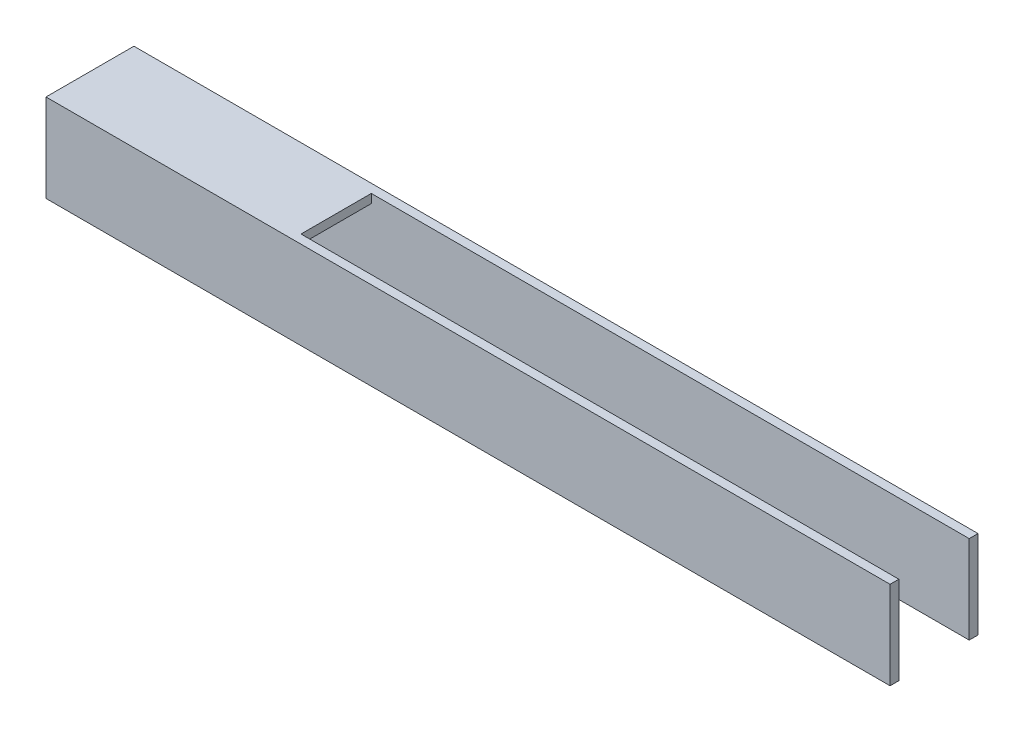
from build123d import *

# Parameters (mm, degrees)
BOSS_EXTRUDE1_DEPTH = 304.8
SKETCH2_W           = 215.9
SKETCH2_H           = 25.4
CUT_EXTRUDE1_DEPTH  = 307.547853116


with BuildPart() as part:
    # Sketch1 → Boss-Extrude1 (new body)
    with BuildSketch(Plane(origin=(0, 0, 0), x_dir=(0, 0, -1), z_dir=(1, 0, 0))):
        Polygon((-15.875, 3.175), (15.875, 3.175), (15.875, -28.575), (12.7, -28.575), (12.7, 0), (-12.7, 0), (-12.7, -28.575), (-15.875, -28.575), align=None)
    extrude(amount=BOSS_EXTRUDE1_DEPTH)

    # Sketch2 → Cut-Extrude1 (cut, through all)
    with BuildSketch(Plane.XZ):
        with Locations((196.85, 0)):
            Rectangle(SKETCH2_W, SKETCH2_H)
    extrude(amount=-CUT_EXTRUDE1_DEPTH, mode=Mode.SUBTRACT)


solid = part.part
